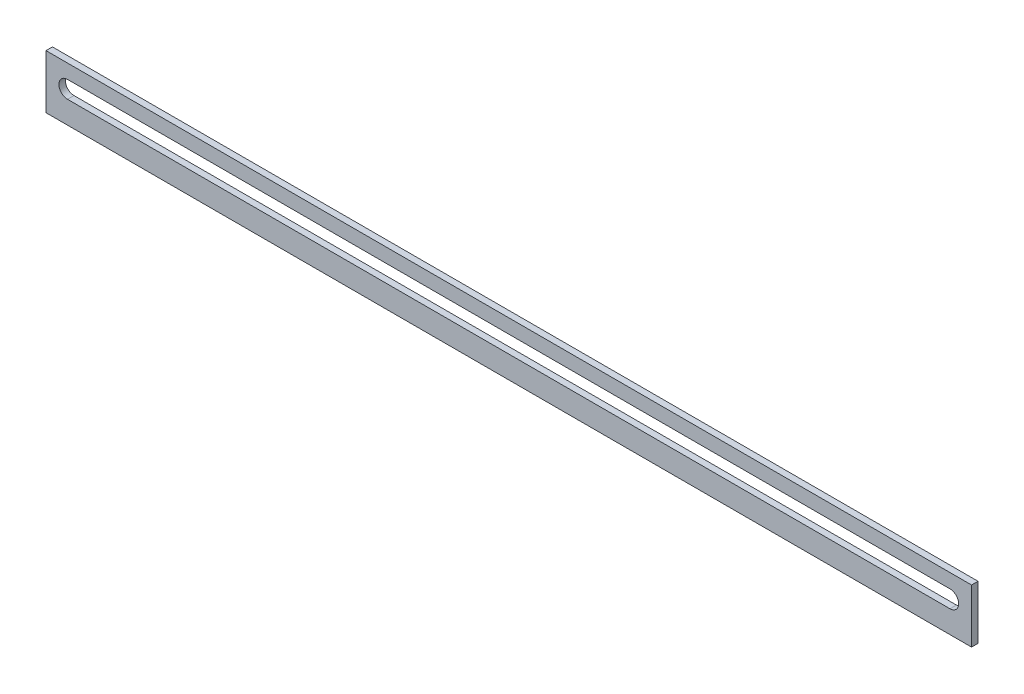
from build123d import *

# Parameters (mm, degrees)
SECTION_CREMAILLERE_W      = 3
SECTION_CREMAILLERE_H      = 16.56159266
BASE_EXTRUSION_DEPTH       = 376.9911192
ENL_V_START                = -374.971195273
ENL_V_MAT_EXTRU_2_DEPTH    = 474.971195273
R_P_TITION_LIN_AIRE1_COUNT = 30
R_P_TITION_LIN_AIRE1_PITCH = 12.56637064
ESQUISSE3_W                = 430
ESQUISSE3_H                = 25
BOSS_EXTRU_1_DEPTH         = 3
ESQUISSE5_W                = 430
ESQUISSE5_H                = 85.974102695
ENL_V_MAT_EXTRU_3_DEPTH    = 402.842052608


with BuildPart() as part:
    # Section Cremaillere → Base-Extrusion (new body)
    with BuildSketch(Plane(origin=(-3.14159266, 0, 0), x_dir=(0, 0, -1), z_dir=(1, 0, 0))):
        with Locations((0, -1.13920367)):
            Rectangle(SECTION_CREMAILLERE_W, SECTION_CREMAILLERE_H)
    extrude(amount=BASE_EXTRUSION_DEPTH)

    # Esquisse1 → Enl_v. mat.-Extru.2 (cut)
    with BuildSketch(Plane.XY.offset(ENL_V_START)):
        with BuildLine():
            Line((1.455582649, 4), (-1.45550134, -3.99977656))
            ThreePointArc((-1.45550134, -3.99977656), (-2.011991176, -4.725082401), (-2.883868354, -5))
            Line((-2.883868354, -5), (-3.14159266, -5))
            Line((-3.14159266, -5), (-3.14159266, 7.14159266))
            Line((-3.14159266, 7.14159266), (9.42477798, 7.14159266))
            Line((9.42477798, 7.14159266), (9.42477798, -5))
            Line((9.42477798, -5), (9.167053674, -5))
            ThreePointArc((9.167053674, -5), (8.295176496, -4.725082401), (7.73868666, -3.99977656))
            Line((7.73868666, -3.99977656), (4.827602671, 4))
            Line((4.827602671, 4), (1.455582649, 4))
        make_face()
    enl_v_mat_extru_2 = extrude(amount=ENL_V_MAT_EXTRU_2_DEPTH, mode=Mode.SUBTRACT)

    # R_p_tition lin_aire1: Enl_v. mat.-Extru.2 ×30
    with Locations(*[(i * R_P_TITION_LIN_AIRE1_PITCH, 0, 0) for i in range(1, R_P_TITION_LIN_AIRE1_COUNT)]):
        add(enl_v_mat_extru_2, mode=Mode.SUBTRACT)

    # Esquisse3 → Boss.-Extru.1 (add, through all)
    with BuildSketch(Plane.XY.offset(1.5)):
        with Locations((185.35396694, -21.92)):
            Rectangle(ESQUISSE3_W, ESQUISSE3_H)
        with BuildLine():
            Line((-19.64603306, -16), (390.35396694, -16))
            ThreePointArc((390.35396694, -16), (394.35396694, -20), (390.35396694, -24))
            Line((390.35396694, -24), (-19.64603306, -24))
            ThreePointArc((-19.64603306, -24), (-23.64603306, -20), (-19.64603306, -16))
        make_face(mode=Mode.SUBTRACT)
    extrude(amount=-BOSS_EXTRU_1_DEPTH)

    # Esquisse5 → Enl_v. mat.-Extru.3 (cut, through all)
    with BuildSketch(Plane.XY.offset(1.5)):
        with Locations((185.35396694, 33.567051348)):
            Rectangle(ESQUISSE5_W, ESQUISSE5_H)
    extrude(amount=-ENL_V_MAT_EXTRU_3_DEPTH, mode=Mode.SUBTRACT)


solid = part.part
